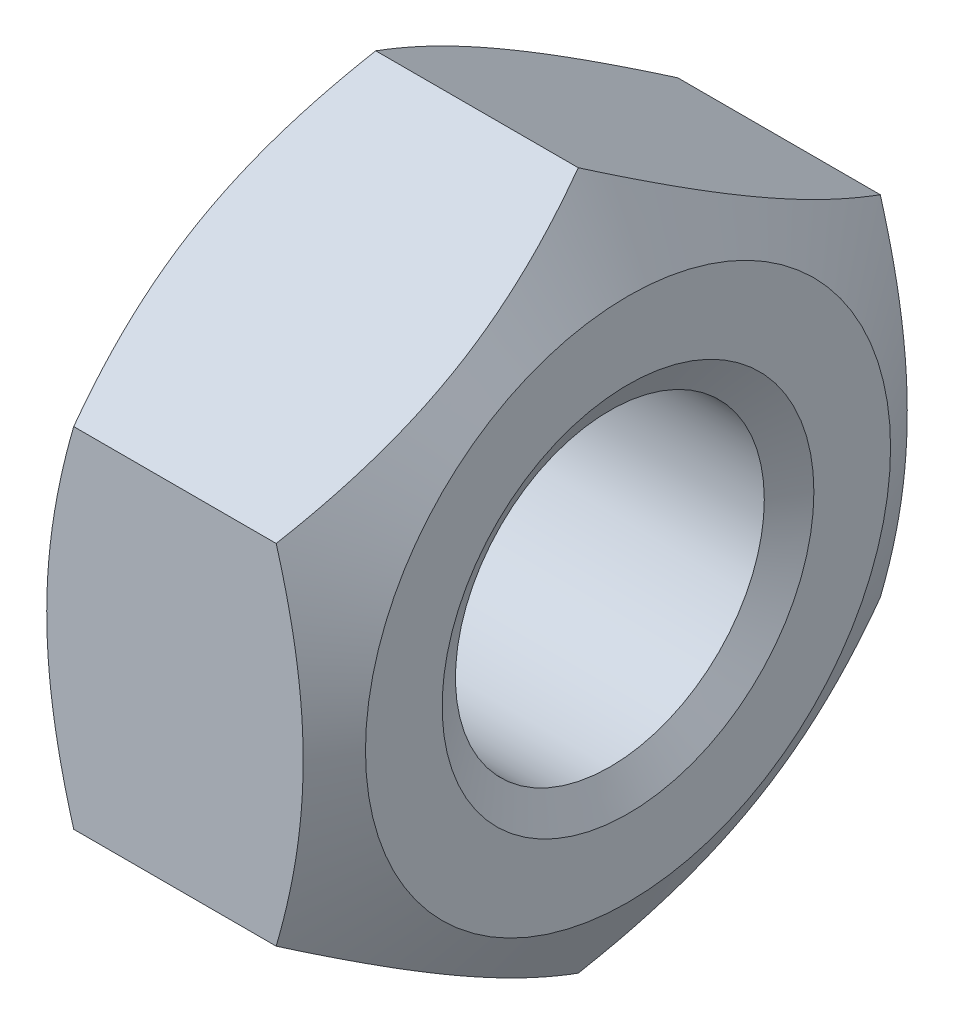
ISO-10303-21;
HEADER;
FILE_DESCRIPTION(('STEP AP214'),'2;1');
FILE_NAME('part.step','',(''),(''),'','','');
FILE_SCHEMA(('AUTOMOTIVE_DESIGN { 1 0 10303 214 1 1 1 1 }'));
ENDSEC;
DATA;
#1=APPLICATION_CONTEXT('core data for automotive mechanical design processes');
#2=APPLICATION_PROTOCOL_DEFINITION('international standard','automotive_design',2000,#1);
#3=PRODUCT_CONTEXT('',#1,'mechanical');
#4=PRODUCT('Part','Part','',(#3));
#5=PRODUCT_RELATED_PRODUCT_CATEGORY('part','',(#4));
#6=PRODUCT_DEFINITION_FORMATION('','',#4);
#7=PRODUCT_DEFINITION_CONTEXT('part definition',#1,'design');
#8=PRODUCT_DEFINITION('design','',#6,#7);
#9=PRODUCT_DEFINITION_SHAPE('','',#8);
#10=(LENGTH_UNIT() NAMED_UNIT(*) SI_UNIT(.MILLI.,.METRE.));
#11=(NAMED_UNIT(*) PLANE_ANGLE_UNIT() SI_UNIT($,.RADIAN.));
#12=(NAMED_UNIT(*) SI_UNIT($,.STERADIAN.) SOLID_ANGLE_UNIT());
#13=UNCERTAINTY_MEASURE_WITH_UNIT(LENGTH_MEASURE(1.E-05),#10,'distance_accuracy_value','');
#14=(GEOMETRIC_REPRESENTATION_CONTEXT(3) GLOBAL_UNCERTAINTY_ASSIGNED_CONTEXT((#13)) GLOBAL_UNIT_ASSIGNED_CONTEXT((#10,
#11,#12)) REPRESENTATION_CONTEXT('',''));
#15=CARTESIAN_POINT('',(0.,0.,0.));
#16=DIRECTION('',(0.,0.,1.));
#17=DIRECTION('',(1.,0.,0.));
#18=AXIS2_PLACEMENT_3D('',#15,#16,#17);
#19=CARTESIAN_POINT('',(0.,-3.75277674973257,6.5));
#20=DIRECTION('',(0.,0.,1.));
#21=DIRECTION('',(1.,0.,0.));
#22=AXIS2_PLACEMENT_3D('',#19,#20,#21);
#23=PLANE('',#22);
#24=CARTESIAN_POINT('',(5.42869565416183,3.75277677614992,6.49999996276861));
#25=CARTESIAN_POINT('',(5.4763117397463,3.58779804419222,6.49999998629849));
#26=CARTESIAN_POINT('',(5.52176664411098,3.42220419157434,6.49999999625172));
#27=CARTESIAN_POINT('',(5.607758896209,3.08967170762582,6.50000000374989));
#28=CARTESIAN_POINT('',(5.64829412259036,2.92273252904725,6.50000000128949));
#29=CARTESIAN_POINT('',(5.76172457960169,2.41924227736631,6.49999999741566));
#30=CARTESIAN_POINT('',(5.8262415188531,2.08070382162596,6.49999999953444));
#31=CARTESIAN_POINT('',(5.90189342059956,1.57408722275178,6.50000000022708));
#32=CARTESIAN_POINT('',(5.92344409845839,1.40752264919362,6.50000000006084));
#33=CARTESIAN_POINT('',(5.95958057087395,1.07364098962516,6.49999999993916));
#34=CARTESIAN_POINT('',(5.97416698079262,0.906323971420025,6.49999999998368));
#35=CARTESIAN_POINT('',(5.99600317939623,0.571399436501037,6.50000000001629));
#36=CARTESIAN_POINT('',(6.00326129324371,0.403792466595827,6.50000000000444));
#37=CARTESIAN_POINT('',(6.01029306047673,0.0684330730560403,6.49999999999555));
#38=CARTESIAN_POINT('',(6.01006694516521,-0.09931934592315,6.49999999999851));
#39=CARTESIAN_POINT('',(5.99916071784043,-0.558877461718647,6.50000000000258));
#40=CARTESIAN_POINT('',(5.98086124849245,-0.850532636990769,6.50000000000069));
#41=CARTESIAN_POINT('',(5.92283973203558,-1.43190589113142,6.4999999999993));
#42=CARTESIAN_POINT('',(5.88309786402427,-1.72162192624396,6.4999999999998));
#43=CARTESIAN_POINT('',(5.78375718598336,-2.30416466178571,6.5000000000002));
#44=CARTESIAN_POINT('',(5.72373758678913,-2.59691787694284,6.5000000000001));
#45=CARTESIAN_POINT('',(5.58751825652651,-3.17805917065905,6.4999999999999));
#46=CARTESIAN_POINT('',(5.51135051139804,-3.46645468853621,6.49999999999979));
#47=CARTESIAN_POINT('',(5.42869571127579,-3.75277666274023,6.5));
#48=B_SPLINE_CURVE_WITH_KNOTS('',3,(#24,#25,#26,#27,#28,#29,#30,#31,#32,#33,#34,#35,#36,#37,#38,
#39,#40,#41,#42,#43,#44,#45,#46,#47),.UNSPECIFIED.,.F.,.F.,(4,2,2,2,2,2,2,2,2,2,2,4),(0.,
0.515097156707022,1.03041563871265,2.06319351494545,2.56693471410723,3.07063139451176,
3.57375521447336,4.07686348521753,4.95263086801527,5.8292091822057,6.72522580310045,
7.61948392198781),.UNSPECIFIED.);
#49=CARTESIAN_POINT('',(5.42869569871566,3.75277677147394,6.49999996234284));
#50=VERTEX_POINT('',#49);
#51=CARTESIAN_POINT('',(5.42869569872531,-3.75277670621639,6.5));
#52=VERTEX_POINT('',#51);
#53=EDGE_CURVE('E92',#50,#52,#48,.T.);
#54=ORIENTED_EDGE('',*,*,#53,.F.);
#55=DIRECTION('',(1.,0.,0.));
#56=VECTOR('',#55,1.);
#57=CARTESIAN_POINT('',(0.,3.75277674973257,6.5));
#58=LINE('',#57,#56);
#59=CARTESIAN_POINT('',(1.07130430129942,3.75277670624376,6.5));
#60=VERTEX_POINT('',#59);
#61=EDGE_CURVE('E80',#60,#50,#58,.T.);
#62=ORIENTED_EDGE('',*,*,#61,.F.);
#63=CARTESIAN_POINT('',(1.07130428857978,-3.75277666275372,6.50000000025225));
#64=CARTESIAN_POINT('',(1.02368821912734,-3.58779792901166,6.50000000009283));
#65=CARTESIAN_POINT('',(0.978233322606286,-3.42220407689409,6.50000000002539));
#66=CARTESIAN_POINT('',(0.892241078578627,-3.08967159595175,6.49999999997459));
#67=CARTESIAN_POINT('',(0.851705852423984,-2.92273241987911,6.49999999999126));
#68=CARTESIAN_POINT('',(0.738275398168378,-2.41924217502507,6.50000000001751));
#69=CARTESIAN_POINT('',(0.673758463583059,-2.0807037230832,6.50000000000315));
#70=CARTESIAN_POINT('',(0.598106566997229,-1.57408713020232,6.49999999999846));
#71=CARTESIAN_POINT('',(0.576555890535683,-1.4075225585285,6.49999999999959));
#72=CARTESIAN_POINT('',(0.54041942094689,-1.07364090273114,6.50000000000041));
#73=CARTESIAN_POINT('',(0.525833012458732,-0.906323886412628,6.50000000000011));
#74=CARTESIAN_POINT('',(0.503996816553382,-0.571399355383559,6.49999999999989));
#75=CARTESIAN_POINT('',(0.496738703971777,-0.403792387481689,6.49999999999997));
#76=CARTESIAN_POINT('',(0.489706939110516,-0.0684329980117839,6.50000000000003));
#77=CARTESIAN_POINT('',(0.489933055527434,0.0993194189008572,6.50000000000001));
#78=CARTESIAN_POINT('',(0.500839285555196,0.558877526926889,6.49999999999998));
#79=CARTESIAN_POINT('',(0.519138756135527,0.850532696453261,6.49999999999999));
#80=CARTESIAN_POINT('',(0.577160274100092,1.43190593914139,6.5));
#81=CARTESIAN_POINT('',(0.616902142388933,1.72162196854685,6.5));
#82=CARTESIAN_POINT('',(0.716242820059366,2.30416469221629,6.5));
#83=CARTESIAN_POINT('',(0.776262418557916,2.59691790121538,6.5));
#84=CARTESIAN_POINT('',(0.91248174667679,3.17805918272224,6.5));
#85=CARTESIAN_POINT('',(0.988649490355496,3.46645469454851,6.5));
#86=CARTESIAN_POINT('',(1.07130428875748,3.7527766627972,6.5));
#87=B_SPLINE_CURVE_WITH_KNOTS('',3,(#63,#64,#65,#66,#67,#68,#69,#70,#71,#72,#73,#74,#75,#76,#77,
#78,#79,#80,#81,#82,#83,#84,#85,#86),.UNSPECIFIED.,.F.,.F.,(4,2,2,2,2,2,2,2,2,2,2,4),(0.,
0.515097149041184,1.03041562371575,2.06319348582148,2.56693467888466,3.07063135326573,
3.57375516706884,4.07686343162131,4.95263079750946,5.82920909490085,6.7252256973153,
7.61948379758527),.UNSPECIFIED.);
#88=CARTESIAN_POINT('',(1.07130431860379,-3.75277674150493,6.50000001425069));
#89=VERTEX_POINT('',#88);
#90=EDGE_CURVE('E116',#89,#60,#87,.T.);
#91=ORIENTED_EDGE('',*,*,#90,.F.);
#92=DIRECTION('',(1.,0.,0.));
#93=VECTOR('',#92,1.);
#94=CARTESIAN_POINT('',(0.,-3.75277674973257,6.5));
#95=LINE('',#94,#93);
#96=EDGE_CURVE('E95',#52,#89,#95,.F.);
#97=ORIENTED_EDGE('',*,*,#96,.F.);
#98=EDGE_LOOP('',(#54,#62,#91,#97));
#99=FACE_BOUND('',#98,.T.);
#100=ADVANCED_FACE('F16',(#99),#23,.T.);
#101=CARTESIAN_POINT('',(0.,3.75277674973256,6.5));
#102=DIRECTION('',(0.,0.866025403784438,0.500000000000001));
#103=DIRECTION('',(0.,-0.500000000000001,0.866025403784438));
#104=AXIS2_PLACEMENT_3D('',#101,#102,#103);
#105=PLANE('',#104);
#106=CARTESIAN_POINT('',(5.42869571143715,7.50555345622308,7.54310346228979E-08));
#107=CARTESIAN_POINT('',(5.47631178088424,7.42306408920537,0.142875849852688));
#108=CARTESIAN_POINT('',(5.52176667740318,7.34026716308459,0.286284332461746));
#109=CARTESIAN_POINT('',(5.60775892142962,7.17400092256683,0.574265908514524));
#110=CARTESIAN_POINT('',(5.64829414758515,7.09053133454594,0.718839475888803));
#111=CARTESIAN_POINT('',(5.76172460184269,6.83878621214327,1.15487481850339));
#112=CARTESIAN_POINT('',(5.82624153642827,6.66951698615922,1.44805771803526));
#113=CARTESIAN_POINT('',(5.90189343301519,6.41620868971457,1.88680055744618));
#114=CARTESIAN_POINT('',(5.92344410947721,6.33292640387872,2.03104970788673));
#115=CARTESIAN_POINT('',(5.95958057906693,6.16598557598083,2.32019970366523));
#116=CARTESIAN_POINT('',(5.97416698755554,6.08232706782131,2.4651004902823));
#117=CARTESIAN_POINT('',(5.99600318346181,5.91486480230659,2.75515364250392));
#118=CARTESIAN_POINT('',(6.00326129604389,5.83106131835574,2.90030553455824));
#119=CARTESIAN_POINT('',(6.01029306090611,5.66338162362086,3.19073528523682));
#120=CARTESIAN_POINT('',(6.01006694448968,5.57950541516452,3.33601313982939));
#121=CARTESIAN_POINT('',(5.99916071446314,5.34972636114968,3.73400213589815));
#122=CARTESIAN_POINT('',(5.98086124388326,5.2038987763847,3.98658292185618));
#123=CARTESIAN_POINT('',(5.92283972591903,4.91321215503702,4.49006691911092));
#124=CARTESIAN_POINT('',(5.88309785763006,4.76835414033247,4.74096836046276));
#125=CARTESIAN_POINT('',(5.78375717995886,4.4770827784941,5.24546515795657));
#126=CARTESIAN_POINT('',(5.72373758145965,4.33070617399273,5.49899687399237));
#127=CARTESIAN_POINT('',(5.58751825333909,4.04013553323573,6.00227998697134));
#128=CARTESIAN_POINT('',(5.51135050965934,3.89593777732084,6.25203782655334));
#129=CARTESIAN_POINT('',(5.42869571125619,3.75277679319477,6.49999992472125));
#130=B_SPLINE_CURVE_WITH_KNOTS('',3,(#106,#107,#108,#109,#110,#111,#112,#113,#114,#115,#116,
#117,#118,#119,#120,#121,#122,#123,#124,#125,#126,#127,#128,#129),.UNSPECIFIED.,.F.,.F.,(4,2,2,
2,2,2,2,2,2,2,2,4),(0.,0.515097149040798,1.03041562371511,2.06319348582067,2.5669346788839,
3.07063135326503,3.57375516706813,4.07686343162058,4.95263079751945,5.82920909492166,
6.7252256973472,7.6194837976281),.UNSPECIFIED.);
#131=CARTESIAN_POINT('',(5.4286956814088,7.50555350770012,1.4263409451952E-08));
#132=VERTEX_POINT('',#131);
#133=EDGE_CURVE('E20',#132,#50,#130,.T.);
#134=ORIENTED_EDGE('',*,*,#133,.F.);
#135=DIRECTION('',(1.,0.,0.));
#136=VECTOR('',#135,1.);
#137=CARTESIAN_POINT('',(0.,7.50555349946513,0.));
#138=LINE('',#137,#136);
#139=CARTESIAN_POINT('',(1.07130430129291,7.50555347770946,3.76819464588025E-08));
#140=VERTEX_POINT('',#139);
#141=EDGE_CURVE('E73',#140,#132,#138,.T.);
#142=ORIENTED_EDGE('',*,*,#141,.F.);
#143=CARTESIAN_POINT('',(1.07130434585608,3.7527767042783,6.50000000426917));
#144=CARTESIAN_POINT('',(1.02368826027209,3.83526609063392,6.35712424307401));
#145=CARTESIAN_POINT('',(0.97823335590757,3.91806302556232,6.21371576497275));
#146=CARTESIAN_POINT('',(0.892241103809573,4.08432927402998,5.92573419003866));
#147=CARTESIAN_POINT('',(0.851705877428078,4.16779886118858,5.78116061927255));
#148=CARTESIAN_POINT('',(0.738275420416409,4.41954398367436,5.34512526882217));
#149=CARTESIAN_POINT('',(0.673758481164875,4.58881321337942,5.05194236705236));
#150=CARTESIAN_POINT('',(0.598106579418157,4.84212151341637,4.61319952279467));
#151=CARTESIAN_POINT('',(0.57655590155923,4.92540380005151,4.46895037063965));
#152=CARTESIAN_POINT('',(0.540419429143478,5.09234462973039,4.17980037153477));
#153=CARTESIAN_POINT('',(0.525833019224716,5.17600313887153,4.03489958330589));
#154=CARTESIAN_POINT('',(0.503996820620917,5.3434654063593,3.7448464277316));
#155=CARTESIAN_POINT('',(0.496738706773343,5.42726889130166,3.5996945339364));
#156=CARTESIAN_POINT('',(0.489706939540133,5.59494858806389,3.3092647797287));
#157=CARTESIAN_POINT('',(0.489933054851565,5.67882479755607,3.16398692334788));
#158=CARTESIAN_POINT('',(0.500839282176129,5.90860385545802,2.76599792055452));
#159=CARTESIAN_POINT('',(0.519138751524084,6.05443144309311,2.51341712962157));
#160=CARTESIAN_POINT('',(0.577160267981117,6.34511807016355,2.00993312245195));
#161=CARTESIAN_POINT('',(0.616902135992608,6.48997608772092,1.75903167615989));
#162=CARTESIAN_POINT('',(0.716242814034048,6.78124745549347,1.25453486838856));
#163=CARTESIAN_POINT('',(0.776262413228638,6.92762406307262,1.0010031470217));
#164=CARTESIAN_POINT('',(0.912481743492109,7.21819470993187,0.497720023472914));
#165=CARTESIAN_POINT('',(0.988649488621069,7.362392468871,0.247962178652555));
#166=CARTESIAN_POINT('',(1.07130428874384,7.50555345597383,7.53291533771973E-08));
#167=B_SPLINE_CURVE_WITH_KNOTS('',3,(#143,#144,#145,#146,#147,#148,#149,#150,#151,#152,#153,
#154,#155,#156,#157,#158,#159,#160,#161,#162,#163,#164,#165,#166),.UNSPECIFIED.,.F.,.F.,(4,2,2,
2,2,2,2,2,2,2,2,4),(0.,0.515097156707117,1.03041563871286,2.06319351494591,2.56693471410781,
3.07063139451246,3.57375521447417,4.07686348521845,4.95263086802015,5.82920918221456,
6.72522580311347,7.61948392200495),.UNSPECIFIED.);
#168=EDGE_CURVE('E83',#60,#140,#167,.T.);
#169=ORIENTED_EDGE('',*,*,#168,.F.);
#170=ORIENTED_EDGE('',*,*,#61,.T.);
#171=EDGE_LOOP('',(#134,#142,#169,#170));
#172=FACE_BOUND('',#171,.T.);
#173=ADVANCED_FACE('F82',(#172),#105,.T.);
#174=CARTESIAN_POINT('',(0.,7.50555349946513,0.));
#175=DIRECTION('',(0.,0.866025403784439,-0.499999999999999));
#176=DIRECTION('',(0.,0.499999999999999,0.866025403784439));
#177=AXIS2_PLACEMENT_3D('',#174,#175,#176);
#178=PLANE('',#177);
#179=CARTESIAN_POINT('',(5.42869565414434,3.7527767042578,-6.50000000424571));
#180=CARTESIAN_POINT('',(5.47631173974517,3.83526609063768,-6.3571242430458));
#181=CARTESIAN_POINT('',(5.52176664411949,3.918063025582,-6.21371576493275));
#182=CARTESIAN_POINT('',(5.60775889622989,4.0843292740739,-5.92573418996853));
#183=CARTESIAN_POINT('',(5.64829412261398,4.16779886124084,-5.78116061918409));
#184=CARTESIAN_POINT('',(5.76172457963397,4.41954398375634,-5.34512526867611));
#185=CARTESIAN_POINT('',(5.82624151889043,4.58881321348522,-5.05194236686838));
#186=CARTESIAN_POINT('',(5.90189342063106,4.84212151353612,-4.61319952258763));
#187=CARTESIAN_POINT('',(5.92344409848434,4.92540380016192,-4.46895037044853));
#188=CARTESIAN_POINT('',(5.95958057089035,5.0923446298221,-4.17980037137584));
#189=CARTESIAN_POINT('',(5.97416698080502,5.17600313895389,-4.03489958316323));
#190=CARTESIAN_POINT('',(5.99600317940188,5.34346540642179,-3.74484642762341));
#191=CARTESIAN_POINT('',(6.0032612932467,5.42726889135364,-3.59969453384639));
#192=CARTESIAN_POINT('',(6.01029306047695,5.59494858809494,-3.30926477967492));
#193=CARTESIAN_POINT('',(6.01006694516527,5.6788247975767,-3.16398692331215));
#194=CARTESIAN_POINT('',(5.99916071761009,5.90860386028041,-2.7659979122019));
#195=CARTESIAN_POINT('',(5.98086124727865,6.05443145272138,-2.51341711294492));
#196=CARTESIAN_POINT('',(5.9228397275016,6.34511808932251,-2.00993308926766));
#197=CARTESIAN_POINT('',(5.88309785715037,6.4899761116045,-1.7590316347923));
#198=CARTESIAN_POINT('',(5.78375717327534,6.78124748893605,-1.2545348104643));
#199=CARTESIAN_POINT('',(5.72373757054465,6.92762410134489,-1.00100308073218));
#200=CARTESIAN_POINT('',(5.58751823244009,7.21819475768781,-0.497719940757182));
#201=CARTESIAN_POINT('',(5.5113504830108,7.36239252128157,-0.247962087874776));
#202=CARTESIAN_POINT('',(5.42869567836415,7.5055535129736,2.33973575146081E-08));
#203=B_SPLINE_CURVE_WITH_KNOTS('',3,(#179,#180,#181,#182,#183,#184,#185,#186,#187,#188,#189,
#190,#191,#192,#193,#194,#195,#196,#197,#198,#199,#200,#201,#202),.UNSPECIFIED.,.F.,.F.,(4,2,2,
2,2,2,2,2,2,2,2,4),(0.,0.51509715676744,1.03041563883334,2.06319351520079,2.5669347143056,
3.07063139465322,3.57375521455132,4.07686348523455,4.95263089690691,5.82920924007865,
6.72522589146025,7.61948404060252),.UNSPECIFIED.);
#204=CARTESIAN_POINT('',(5.42869569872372,3.75277670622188,-6.5));
#205=VERTEX_POINT('',#204);
#206=EDGE_CURVE('E94',#205,#132,#203,.T.);
#207=ORIENTED_EDGE('',*,*,#206,.F.);
#208=DIRECTION('',(-1.,0.,0.));
#209=VECTOR('',#208,1.);
#210=CARTESIAN_POINT('',(0.,3.75277674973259,-6.5));
#211=LINE('',#210,#209);
#212=CARTESIAN_POINT('',(1.07130430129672,3.75277677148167,-6.49999996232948));
#213=VERTEX_POINT('',#212);
#214=EDGE_CURVE('E189',#213,#205,#211,.F.);
#215=ORIENTED_EDGE('',*,*,#214,.F.);
#216=CARTESIAN_POINT('',(1.07130434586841,7.50555348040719,4.14999745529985E-08));
#217=CARTESIAN_POINT('',(1.02368826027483,7.42306413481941,-0.142875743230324));
#218=CARTESIAN_POINT('',(0.978233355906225,7.34026721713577,-0.28628423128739));
#219=CARTESIAN_POINT('',(0.892241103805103,7.17400098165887,-0.574265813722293));
#220=CARTESIAN_POINT('',(0.851705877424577,7.09053139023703,-0.718839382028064));
#221=CARTESIAN_POINT('',(0.73827542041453,6.83878626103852,-1.15487472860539));
#222=CARTESIAN_POINT('',(0.673758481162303,6.66951703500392,-1.44805763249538));
#223=CARTESIAN_POINT('',(0.598106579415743,6.41620873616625,-1.8868004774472));
#224=CARTESIAN_POINT('',(0.576555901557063,6.33292644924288,-2.03104962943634));
#225=CARTESIAN_POINT('',(0.540419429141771,6.16598561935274,-2.32019962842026));
#226=CARTESIAN_POINT('',(0.525833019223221,6.08232711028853,-2.46510041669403));
#227=CARTESIAN_POINT('',(0.503996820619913,5.91486484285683,-2.75515357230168));
#228=CARTESIAN_POINT('',(0.496738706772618,5.83106135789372,-2.90030546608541));
#229=CARTESIAN_POINT('',(0.489706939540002,5.66338166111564,-3.19073522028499));
#230=CARTESIAN_POINT('',(0.489933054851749,5.57950545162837,-3.33601307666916));
#231=CARTESIAN_POINT('',(0.500839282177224,5.34972639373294,-3.73400207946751));
#232=CARTESIAN_POINT('',(0.519138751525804,5.20389880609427,-3.98658287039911));
#233=CARTESIAN_POINT('',(0.577160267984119,4.91321217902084,-4.49006687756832));
#234=CARTESIAN_POINT('',(0.616902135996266,4.76835416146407,-4.74096832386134));
#235=CARTESIAN_POINT('',(0.716242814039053,4.47708279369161,-5.24546513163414));
#236=CARTESIAN_POINT('',(0.776262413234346,4.33070618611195,-5.49899685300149));
#237=CARTESIAN_POINT('',(0.91248174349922,4.04013553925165,-6.00227997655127));
#238=CARTESIAN_POINT('',(0.988649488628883,3.89593778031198,-6.25203782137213));
#239=CARTESIAN_POINT('',(1.07130428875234,3.75277679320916,-6.49999992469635));
#240=B_SPLINE_CURVE_WITH_KNOTS('',3,(#216,#217,#218,#219,#220,#221,#222,#223,#224,#225,#226,
#227,#228,#229,#230,#231,#232,#233,#234,#235,#236,#237,#238,#239),.UNSPECIFIED.,.F.,.F.,(4,2,2,
2,2,2,2,2,2,2,2,4),(0.,0.515097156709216,1.03041563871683,2.06319351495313,2.56693471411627,
3.0706313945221,3.57375521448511,4.07686348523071,4.95263086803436,5.82920918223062,
6.72522580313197,7.61948392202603),.UNSPECIFIED.);
#241=EDGE_CURVE('E159',#140,#213,#240,.T.);
#242=ORIENTED_EDGE('',*,*,#241,.F.);
#243=ORIENTED_EDGE('',*,*,#141,.T.);
#244=EDGE_LOOP('',(#207,#215,#242,#243));
#245=FACE_BOUND('',#244,.T.);
#246=ADVANCED_FACE('F163',(#245),#178,.T.);
#247=CARTESIAN_POINT('',(0.,3.75277674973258,-6.5));
#248=DIRECTION('',(0.,0.,-1.));
#249=DIRECTION('',(-1.,0.,0.));
#250=AXIS2_PLACEMENT_3D('',#247,#248,#249);
#251=PLANE('',#250);
#252=CARTESIAN_POINT('',(5.4286956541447,-3.75277677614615,-6.49999996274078));
#253=CARTESIAN_POINT('',(5.4763117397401,-3.5877980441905,-6.49999998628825));
#254=CARTESIAN_POINT('',(5.52176664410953,-3.42220419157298,-6.49999999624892));
#255=CARTESIAN_POINT('',(5.60775889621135,-3.0896717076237,-6.50000000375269));
#256=CARTESIAN_POINT('',(5.64829412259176,-2.92273252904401,-6.50000000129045));
#257=CARTESIAN_POINT('',(5.7617245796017,-2.41924227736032,-6.49999999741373));
#258=CARTESIAN_POINT('',(5.82624151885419,-2.08070382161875,-6.49999999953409));
#259=CARTESIAN_POINT('',(5.90189342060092,-1.57408722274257,-6.50000000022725));
#260=CARTESIAN_POINT('',(5.92344409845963,-1.40752264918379,-6.50000000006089));
#261=CARTESIAN_POINT('',(5.95958057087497,-1.07364098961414,-6.49999999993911));
#262=CARTESIAN_POINT('',(5.97416698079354,-0.90632397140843,-6.49999999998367));
#263=CARTESIAN_POINT('',(5.99600317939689,-0.571399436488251,-6.50000000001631));
#264=CARTESIAN_POINT('',(6.0032612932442,-0.403792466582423,-6.50000000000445));
#265=CARTESIAN_POINT('',(6.01029306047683,-0.0684330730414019,-6.49999999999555));
#266=CARTESIAN_POINT('',(6.01006694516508,0.0993193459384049,-6.49999999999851));
#267=CARTESIAN_POINT('',(5.99916071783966,0.558877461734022,-6.50000000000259));
#268=CARTESIAN_POINT('',(5.98086124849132,0.850532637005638,-6.5000000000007));
#269=CARTESIAN_POINT('',(5.92283973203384,1.43190589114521,-6.4999999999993));
#270=CARTESIAN_POINT('',(5.88309786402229,1.7216219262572,-6.4999999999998));
#271=CARTESIAN_POINT('',(5.78375718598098,2.30416466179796,-6.5000000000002));
#272=CARTESIAN_POINT('',(5.72373758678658,2.59691787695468,-6.5000000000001));
#273=CARTESIAN_POINT('',(5.58751825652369,3.17805917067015,-6.4999999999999));
#274=CARTESIAN_POINT('',(5.5113505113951,3.46645468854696,-6.49999999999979));
#275=CARTESIAN_POINT('',(5.42869571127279,3.75277666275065,-6.5));
#276=B_SPLINE_CURVE_WITH_KNOTS('',3,(#252,#253,#254,#255,#256,#257,#258,#259,#260,#261,#262,
#263,#264,#265,#266,#267,#268,#269,#270,#271,#272,#273,#274,#275),.UNSPECIFIED.,.F.,.F.,(4,2,2,
2,2,2,2,2,2,2,2,4),(0.,0.515097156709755,1.03041563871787,2.06319351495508,2.56693471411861,
3.07063139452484,3.57375521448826,4.07686348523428,4.95263086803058,5.82920918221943,
6.72522580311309,7.61948392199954),.UNSPECIFIED.);
#277=CARTESIAN_POINT('',(5.42869569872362,-3.75277677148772,-6.49999996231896));
#278=VERTEX_POINT('',#277);
#279=EDGE_CURVE('E174',#278,#205,#276,.T.);
#280=ORIENTED_EDGE('',*,*,#279,.F.);
#281=DIRECTION('',(1.,0.,0.));
#282=VECTOR('',#281,1.);
#283=CARTESIAN_POINT('',(0.,-3.75277674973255,-6.50000000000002));
#284=LINE('',#283,#282);
#285=CARTESIAN_POINT('',(1.07130430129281,-3.75277670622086,-6.50000000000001));
#286=VERTEX_POINT('',#285);
#287=EDGE_CURVE('E187',#286,#278,#284,.T.);
#288=ORIENTED_EDGE('',*,*,#287,.F.);
#289=CARTESIAN_POINT('',(1.07130434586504,3.75277677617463,-6.49999996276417));
#290=CARTESIAN_POINT('',(1.02368826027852,3.58779804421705,-6.49999998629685));
#291=CARTESIAN_POINT('',(0.978233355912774,3.42220419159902,-6.49999999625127));
#292=CARTESIAN_POINT('',(0.892241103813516,3.08967170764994,-6.50000000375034));
#293=CARTESIAN_POINT('',(0.851705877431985,2.92273252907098,-6.50000000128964));
#294=CARTESIAN_POINT('',(0.738275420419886,2.41924227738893,-6.49999999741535));
#295=CARTESIAN_POINT('',(0.673758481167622,2.08070382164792,-6.49999999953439));
#296=CARTESIAN_POINT('',(0.598106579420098,1.57408722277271,-6.5000000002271));
#297=CARTESIAN_POINT('',(0.576555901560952,1.40752264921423,-6.50000000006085));
#298=CARTESIAN_POINT('',(0.540419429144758,1.07364098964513,-6.49999999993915));
#299=CARTESIAN_POINT('',(0.525833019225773,0.90632397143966,-6.49999999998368));
#300=CARTESIAN_POINT('',(0.503996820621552,0.571399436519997,-6.5000000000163));
#301=CARTESIAN_POINT('',(0.49673870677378,0.403792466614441,-6.50000000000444));
#302=CARTESIAN_POINT('',(0.489706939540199,0.0684330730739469,-6.49999999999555));
#303=CARTESIAN_POINT('',(0.489933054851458,-0.0993193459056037,-6.49999999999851));
#304=CARTESIAN_POINT('',(0.500839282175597,-0.558877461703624,-6.50000000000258));
#305=CARTESIAN_POINT('',(0.519138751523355,-0.850532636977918,-6.5000000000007));
#306=CARTESIAN_POINT('',(0.577160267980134,-1.43190589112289,-6.4999999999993));
#307=CARTESIAN_POINT('',(0.616902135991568,-1.7216219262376,-6.4999999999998));
#308=CARTESIAN_POINT('',(0.716242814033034,-2.30416466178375,-6.5000000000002));
#309=CARTESIAN_POINT('',(0.776262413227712,-2.59691787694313,-6.5000000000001));
#310=CARTESIAN_POINT('',(0.912481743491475,-3.17805917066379,-6.4999999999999));
#311=CARTESIAN_POINT('',(0.988649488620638,-3.46645468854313,-6.49999999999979));
#312=CARTESIAN_POINT('',(1.07130428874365,-3.75277666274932,-6.5));
#313=B_SPLINE_CURVE_WITH_KNOTS('',3,(#289,#290,#291,#292,#293,#294,#295,#296,#297,#298,#299,
#300,#301,#302,#303,#304,#305,#306,#307,#308,#309,#310,#311,#312),.UNSPECIFIED.,.F.,.F.,(4,2,2,
2,2,2,2,2,2,2,2,4),(0.,0.515097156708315,1.0304156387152,2.06319351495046,2.56693471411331,
3.0706313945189,3.57375521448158,4.07686348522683,4.95263086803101,5.82920918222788,
6.72522580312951,7.61948392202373),.UNSPECIFIED.);
#314=EDGE_CURVE('E154',#213,#286,#313,.T.);
#315=ORIENTED_EDGE('',*,*,#314,.F.);
#316=ORIENTED_EDGE('',*,*,#214,.T.);
#317=EDGE_LOOP('',(#280,#288,#315,#316));
#318=FACE_BOUND('',#317,.T.);
#319=ADVANCED_FACE('F166',(#318),#251,.T.);
#320=CARTESIAN_POINT('',(0.,-3.75277674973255,-6.50000000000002));
#321=DIRECTION('',(0.,-0.866025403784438,-0.500000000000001));
#322=DIRECTION('',(0.,0.500000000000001,-0.866025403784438));
#323=AXIS2_PLACEMENT_3D('',#320,#321,#322);
#324=PLANE('',#323);
#325=CARTESIAN_POINT('',(5.42869565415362,-7.50555348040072,4.14862084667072E-08));
#326=CARTESIAN_POINT('',(5.47631173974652,-7.42306413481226,-0.142875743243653));
#327=CARTESIAN_POINT('',(5.52176664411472,-7.34026721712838,-0.286284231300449));
#328=CARTESIAN_POINT('',(5.60775889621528,-7.17400098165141,-0.574265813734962));
#329=CARTESIAN_POINT('',(5.64829412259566,-7.09053139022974,-0.718839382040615));
#330=CARTESIAN_POINT('',(5.76172457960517,-6.83878626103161,-1.15487472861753));
#331=CARTESIAN_POINT('',(5.82624151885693,-6.66951703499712,-1.44805763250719));
#332=CARTESIAN_POINT('',(5.90189342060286,-6.41620873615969,-1.88680047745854));
#333=CARTESIAN_POINT('',(5.92344409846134,-6.3329264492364,-2.03104962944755));
#334=CARTESIAN_POINT('',(5.95958057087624,-6.16598561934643,-2.32019962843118));
#335=CARTESIAN_POINT('',(5.9741669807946,-6.0823271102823,-2.46510041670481));
#336=CARTESIAN_POINT('',(5.99600317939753,-5.91486484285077,-2.75515357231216));
#337=CARTESIAN_POINT('',(6.00326129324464,-5.83106135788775,-2.90030546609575));
#338=CARTESIAN_POINT('',(6.0102930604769,-5.66338166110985,-3.19073522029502));
#339=CARTESIAN_POINT('',(6.01006694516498,-5.57950545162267,-3.33601307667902));
#340=CARTESIAN_POINT('',(5.99916071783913,-5.34972639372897,-3.73400207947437));
#341=CARTESIAN_POINT('',(5.9808612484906,-5.20389880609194,-3.98658287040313));
#342=CARTESIAN_POINT('',(5.92283973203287,-4.91321217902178,-4.49006687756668));
#343=CARTESIAN_POINT('',(5.88309786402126,-4.76835416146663,-4.74096832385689));
#344=CARTESIAN_POINT('',(5.78375718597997,-4.47708279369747,-5.24546513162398));
#345=CARTESIAN_POINT('',(5.72373758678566,-4.33070618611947,-5.49899685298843));
#346=CARTESIAN_POINT('',(5.58751825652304,-4.04013553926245,-6.00227997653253));
#347=CARTESIAN_POINT('',(5.51135051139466,-3.8959377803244,-6.2520378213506));
#348=CARTESIAN_POINT('',(5.42869571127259,-3.75277679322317,-6.49999992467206));
#349=B_SPLINE_CURVE_WITH_KNOTS('',3,(#325,#326,#327,#328,#329,#330,#331,#332,#333,#334,#335,
#336,#337,#338,#339,#340,#341,#342,#343,#344,#345,#346,#347,#348),.UNSPECIFIED.,.F.,.F.,(4,2,2,
2,2,2,2,2,2,2,2,4),(0.,0.51509715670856,1.03041563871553,2.06319351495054,2.56693471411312,
3.07063139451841,3.57375521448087,4.07686348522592,4.95263086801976,5.82920918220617,
6.72522580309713,7.61948392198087),.UNSPECIFIED.);
#350=CARTESIAN_POINT('',(5.42869569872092,-7.50555347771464,3.76729568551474E-08));
#351=VERTEX_POINT('',#350);
#352=EDGE_CURVE('E98',#351,#278,#349,.T.);
#353=ORIENTED_EDGE('',*,*,#352,.F.);
#354=DIRECTION('',(1.,0.,0.));
#355=VECTOR('',#354,1.);
#356=CARTESIAN_POINT('',(0.,-7.50555349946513,0.));
#357=LINE('',#356,#355);
#358=CARTESIAN_POINT('',(1.07130430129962,-7.50555347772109,-3.76617956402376E-08));
#359=VERTEX_POINT('',#358);
#360=EDGE_CURVE('E191',#359,#351,#357,.T.);
#361=ORIENTED_EDGE('',*,*,#360,.F.);
#362=CARTESIAN_POINT('',(1.07130434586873,-3.75277670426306,-6.50000000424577));
#363=CARTESIAN_POINT('',(1.02368826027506,-3.83526609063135,-6.35712424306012));
#364=CARTESIAN_POINT('',(0.978233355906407,-3.91806302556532,-6.21371576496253));
#365=CARTESIAN_POINT('',(0.892241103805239,-4.08432927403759,-5.92573419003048));
#366=CARTESIAN_POINT('',(0.851705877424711,-4.16779886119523,-5.78116061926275));
#367=CARTESIAN_POINT('',(0.738275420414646,-4.41954398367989,-5.34512526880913));
#368=CARTESIAN_POINT('',(0.673758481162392,-4.58881321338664,-5.05194236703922));
#369=CARTESIAN_POINT('',(0.598106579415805,-4.84212151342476,-4.61319952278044));
#370=CARTESIAN_POINT('',(0.576555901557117,-4.92540380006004,-4.46895037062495));
#371=CARTESIAN_POINT('',(0.540419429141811,-5.09234462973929,-4.17980037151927));
#372=CARTESIAN_POINT('',(0.525833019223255,-5.17600313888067,-4.03489958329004));
#373=CARTESIAN_POINT('',(0.503996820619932,-5.34346540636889,-3.74484642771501));
#374=CARTESIAN_POINT('',(0.496738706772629,-5.42726889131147,-3.59969453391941));
#375=CARTESIAN_POINT('',(0.48970693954,-5.59494858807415,-3.30926477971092));
#376=CARTESIAN_POINT('',(0.489933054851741,-5.67882479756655,-3.16398692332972));
#377=CARTESIAN_POINT('',(0.50083928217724,-5.90860385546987,-2.765997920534));
#378=CARTESIAN_POINT('',(0.519138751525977,-6.05443144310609,-2.51341712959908));
#379=CARTESIAN_POINT('',(0.577160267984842,-6.34511807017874,-2.00993312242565));
#380=CARTESIAN_POINT('',(0.61690213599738,-6.48997608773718,-1.75903167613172));
#381=CARTESIAN_POINT('',(0.716242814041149,-6.78124745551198,-1.25453486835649));
#382=CARTESIAN_POINT('',(0.776262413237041,-6.9276240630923,-1.0010031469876));
#383=CARTESIAN_POINT('',(0.912481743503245,-7.21819470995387,-0.497720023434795));
#384=CARTESIAN_POINT('',(0.988649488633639,-7.36239246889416,-0.247962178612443));
#385=CARTESIAN_POINT('',(1.07130428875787,-7.50555345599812,-7.52870720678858E-08));
#386=B_SPLINE_CURVE_WITH_KNOTS('',3,(#362,#363,#364,#365,#366,#367,#368,#369,#370,#371,#372,
#373,#374,#375,#376,#377,#378,#379,#380,#381,#382,#383,#384,#385),.UNSPECIFIED.,.F.,.F.,(4,2,2,
2,2,2,2,2,2,2,2,4),(0.,0.515097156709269,1.03041563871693,2.06319351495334,2.56693471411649,
3.07063139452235,3.57375521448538,4.07686348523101,4.95263086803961,5.82920918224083,
6.72522580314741,7.61948392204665),.UNSPECIFIED.);
#387=EDGE_CURVE('E40',#286,#359,#386,.T.);
#388=ORIENTED_EDGE('',*,*,#387,.F.);
#389=ORIENTED_EDGE('',*,*,#287,.T.);
#390=EDGE_LOOP('',(#353,#361,#388,#389));
#391=FACE_BOUND('',#390,.T.);
#392=ADVANCED_FACE('F170',(#391),#324,.T.);
#393=CARTESIAN_POINT('',(0.,-7.50555349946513,0.));
#394=DIRECTION('',(0.,-0.866025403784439,0.5));
#395=DIRECTION('',(0.,-0.5,-0.866025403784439));
#396=AXIS2_PLACEMENT_3D('',#393,#394,#395);
#397=PLANE('',#396);
#398=CARTESIAN_POINT('',(5.4286956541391,-3.75277670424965,6.50000000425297));
#399=CARTESIAN_POINT('',(5.47631173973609,-3.83526609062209,6.35712424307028));
#400=CARTESIAN_POINT('',(5.52176664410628,-3.91806302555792,6.21371576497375));
#401=CARTESIAN_POINT('',(5.60775889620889,-4.08432927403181,5.92573419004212));
#402=CARTESIAN_POINT('',(5.64829412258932,-4.16779886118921,5.78116061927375));
#403=CARTESIAN_POINT('',(5.76172457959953,-4.41954398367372,5.34512526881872));
#404=CARTESIAN_POINT('',(5.82624151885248,-4.58881321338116,5.05194236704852));
#405=CARTESIAN_POINT('',(5.90189342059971,-4.84212151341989,4.61319952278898));
#406=CARTESIAN_POINT('',(5.92344409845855,-4.92540380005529,4.46895037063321));
#407=CARTESIAN_POINT('',(5.95958057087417,-5.09234462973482,4.17980037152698));
#408=CARTESIAN_POINT('',(5.97416698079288,-5.17600313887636,4.0348995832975));
#409=CARTESIAN_POINT('',(5.99600317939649,-5.3434654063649,3.74484642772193));
#410=CARTESIAN_POINT('',(6.00326129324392,-5.42726889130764,3.59969453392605));
#411=CARTESIAN_POINT('',(6.01029306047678,-5.59494858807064,3.309264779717));
#412=CARTESIAN_POINT('',(6.01006694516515,-5.67882479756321,3.1639869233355));
#413=CARTESIAN_POINT('',(5.99916071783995,-5.9086038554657,2.76599792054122));
#414=CARTESIAN_POINT('',(5.98086124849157,-6.05443144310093,2.51341712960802));
#415=CARTESIAN_POINT('',(5.92283973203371,-6.34511807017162,2.00993312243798));
#416=CARTESIAN_POINT('',(5.8830978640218,-6.48997608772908,1.75903167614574));
#417=CARTESIAN_POINT('',(5.78375718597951,-6.78124745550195,1.25453486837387));
#418=CARTESIAN_POINT('',(5.72373758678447,-6.9276240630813,1.00100314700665));
#419=CARTESIAN_POINT('',(5.58751825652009,-7.21819470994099,0.49772002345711));
#420=CARTESIAN_POINT('',(5.51135051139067,-7.36239246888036,0.247962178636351));
#421=CARTESIAN_POINT('',(5.42869571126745,-7.50555345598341,7.53125526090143E-08));
#422=B_SPLINE_CURVE_WITH_KNOTS('',3,(#398,#399,#400,#401,#402,#403,#404,#405,#406,#407,#408,
#409,#410,#411,#412,#413,#414,#415,#416,#417,#418,#419,#420,#421),.UNSPECIFIED.,.F.,.F.,(4,2,2,
2,2,2,2,2,2,2,2,4),(0.,0.515097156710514,1.03041563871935,2.06319351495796,2.56693471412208,
3.07063139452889,3.5737552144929,4.07686348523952,4.95263086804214,5.82920918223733,
6.72522580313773,7.6194839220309),.UNSPECIFIED.);
#423=EDGE_CURVE('E97',#52,#351,#422,.T.);
#424=ORIENTED_EDGE('',*,*,#423,.F.);
#425=ORIENTED_EDGE('',*,*,#96,.T.);
#426=CARTESIAN_POINT('',(1.07130434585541,-7.50555348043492,-4.14977591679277E-08));
#427=CARTESIAN_POINT('',(1.02368826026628,-7.42306413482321,0.142875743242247));
#428=CARTESIAN_POINT('',(0.978233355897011,-7.34026721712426,0.286284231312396));
#429=CARTESIAN_POINT('',(0.892241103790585,-7.17400098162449,0.574265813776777));
#430=CARTESIAN_POINT('',(0.851705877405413,-7.09053139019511,0.718839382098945));
#431=CARTESIAN_POINT('',(0.73827542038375,-6.83878626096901,1.15487472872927));
#432=CARTESIAN_POINT('',(0.673758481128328,-6.66951703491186,1.44805763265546));
#433=CARTESIAN_POINT('',(0.5981065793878,-6.41620873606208,1.88680047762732));
#434=CARTESIAN_POINT('',(0.576555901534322,-6.33292644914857,2.03104962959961));
#435=CARTESIAN_POINT('',(0.540419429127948,-6.16598561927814,2.32019962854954));
#436=CARTESIAN_POINT('',(0.525833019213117,-6.08232711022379,2.46510041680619));
#437=CARTESIAN_POINT('',(0.503996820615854,-5.91486484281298,2.75515357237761));
#438=CARTESIAN_POINT('',(0.496738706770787,-5.8310613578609,2.90030546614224));
#439=CARTESIAN_POINT('',(0.489706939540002,-5.66338166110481,3.19073522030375));
#440=CARTESIAN_POINT('',(0.489933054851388,-5.57950545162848,3.33601307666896));
#441=CARTESIAN_POINT('',(0.500839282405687,-5.34972638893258,3.73400208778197));
#442=CARTESIAN_POINT('',(0.519138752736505,-5.20389879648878,3.98658288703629));
#443=CARTESIAN_POINT('',(0.577160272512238,-4.91321215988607,4.49006691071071));
#444=CARTESIAN_POINT('',(0.616902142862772,-4.76835413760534,4.74096836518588));
#445=CARTESIAN_POINT('',(0.716242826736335,-4.47708276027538,5.24546518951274));
#446=CARTESIAN_POINT('',(0.776262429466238,-4.33070614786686,5.49899691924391));
#447=CARTESIAN_POINT('',(0.912481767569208,-4.04013549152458,6.00228005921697));
#448=CARTESIAN_POINT('',(0.988649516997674,-3.89593772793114,6.2520379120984));
#449=CARTESIAN_POINT('',(1.07130432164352,-3.75277673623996,6.50000002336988));
#450=B_SPLINE_CURVE_WITH_KNOTS('',3,(#426,#427,#428,#429,#430,#431,#432,#433,#434,#435,#436,
#437,#438,#439,#440,#441,#442,#443,#444,#445,#446,#447,#448,#449),.UNSPECIFIED.,.F.,.F.,(4,2,2,
2,2,2,2,2,2,2,2,4),(0.,0.515097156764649,1.03041563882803,2.06319351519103,2.56693471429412,
3.07063139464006,3.57375521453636,4.07686348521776,4.95263089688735,5.82920924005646,
6.72522589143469,7.61948404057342),.UNSPECIFIED.);
#451=EDGE_CURVE('E142',#359,#89,#450,.T.);
#452=ORIENTED_EDGE('',*,*,#451,.F.);
#453=ORIENTED_EDGE('',*,*,#360,.T.);
#454=EDGE_LOOP('',(#424,#425,#452,#453));
#455=FACE_BOUND('',#454,.T.);
#456=ADVANCED_FACE('F210',(#455),#397,.T.);
#457=CARTESIAN_POINT('',(5.42226786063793,0.,0.));
#458=DIRECTION('',(-1.,0.,0.));
#459=DIRECTION('',(0.,0.,1.));
#460=AXIS2_PLACEMENT_3D('',#457,#458,#459);
#461=CONICAL_SURFACE('',#460,7.51668681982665,1.04719755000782);
#462=CARTESIAN_POINT('',(6.50000000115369,0.,0.));
#463=DIRECTION('',(-1.,0.,0.));
#464=DIRECTION('',(0.,0.,1.));
#465=AXIS2_PLACEMENT_3D('',#462,#463,#464);
#466=CIRCLE('',#465,5.6500000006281);
#467=CARTESIAN_POINT('',(6.50000000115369,0.,5.6500000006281));
#468=VERTEX_POINT('',#467);
#469=EDGE_CURVE('E204',#468,#468,#466,.F.);
#470=ORIENTED_EDGE('',*,*,#469,.F.);
#471=EDGE_LOOP('',(#470));
#472=FACE_BOUND('',#471,.T.);
#473=ORIENTED_EDGE('',*,*,#279,.T.);
#474=ORIENTED_EDGE('',*,*,#206,.T.);
#475=ORIENTED_EDGE('',*,*,#133,.T.);
#476=ORIENTED_EDGE('',*,*,#53,.T.);
#477=ORIENTED_EDGE('',*,*,#423,.T.);
#478=ORIENTED_EDGE('',*,*,#352,.T.);
#479=EDGE_LOOP('',(#473,#474,#475,#476,#477,#478));
#480=FACE_BOUND('',#479,.T.);
#481=ADVANCED_FACE('F90',(#472,#480),#461,.T.);
#482=CARTESIAN_POINT('',(1.0777321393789,0.,0.));
#483=DIRECTION('',(1.,0.,0.));
#484=DIRECTION('',(0.,0.,-1.));
#485=AXIS2_PLACEMENT_3D('',#482,#483,#484);
#486=CONICAL_SURFACE('',#485,7.51668681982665,1.04719755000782);
#487=CARTESIAN_POINT('',(-1.13686837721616E-09,0.,0.));
#488=DIRECTION('',(1.,0.,0.));
#489=DIRECTION('',(0.,0.,-1.));
#490=AXIS2_PLACEMENT_3D('',#487,#488,#489);
#491=CIRCLE('',#490,5.6500000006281);
#492=CARTESIAN_POINT('',(-1.13686837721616E-09,0.,-5.6500000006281));
#493=VERTEX_POINT('',#492);
#494=EDGE_CURVE('E202',#493,#493,#491,.T.);
#495=ORIENTED_EDGE('',*,*,#494,.T.);
#496=EDGE_LOOP('',(#495));
#497=FACE_BOUND('',#496,.T.);
#498=ORIENTED_EDGE('',*,*,#387,.T.);
#499=ORIENTED_EDGE('',*,*,#451,.T.);
#500=ORIENTED_EDGE('',*,*,#90,.T.);
#501=ORIENTED_EDGE('',*,*,#168,.T.);
#502=ORIENTED_EDGE('',*,*,#241,.T.);
#503=ORIENTED_EDGE('',*,*,#314,.T.);
#504=EDGE_LOOP('',(#498,#499,#500,#501,#502,#503));
#505=FACE_BOUND('',#504,.T.);
#506=ADVANCED_FACE('F130',(#497,#505),#486,.T.);
#507=CARTESIAN_POINT('',(6.5,0.,0.));
#508=DIRECTION('',(1.,0.,0.));
#509=DIRECTION('',(0.,0.,-1.));
#510=AXIS2_PLACEMENT_3D('',#507,#508,#509);
#511=PLANE('',#510);
#512=CARTESIAN_POINT('',(6.50000000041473,0.,0.));
#513=DIRECTION('',(1.,0.,0.));
#514=DIRECTION('',(0.,0.,-1.));
#515=AXIS2_PLACEMENT_3D('',#512,#513,#514);
#516=CIRCLE('',#515,4.00008234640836);
#517=CARTESIAN_POINT('',(6.50000000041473,0.,-4.00008234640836));
#518=VERTEX_POINT('',#517);
#519=EDGE_CURVE('E199',#518,#518,#516,.F.);
#520=ORIENTED_EDGE('',*,*,#519,.T.);
#521=EDGE_LOOP('',(#520));
#522=FACE_BOUND('',#521,.T.);
#523=ORIENTED_EDGE('',*,*,#469,.T.);
#524=EDGE_LOOP('',(#523));
#525=FACE_BOUND('',#524,.T.);
#526=ADVANCED_FACE('F134',(#522,#525),#511,.T.);
#527=CARTESIAN_POINT('',(0.,0.,0.));
#528=DIRECTION('',(1.,0.,0.));
#529=DIRECTION('',(0.,0.,-1.));
#530=AXIS2_PLACEMENT_3D('',#527,#528,#529);
#531=PLANE('',#530);
#532=CARTESIAN_POINT('',(-3.97903932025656E-10,0.,0.));
#533=DIRECTION('',(-1.,0.,0.));
#534=DIRECTION('',(0.,-1.,0.));
#535=AXIS2_PLACEMENT_3D('',#532,#533,#534);
#536=CIRCLE('',#535,4.00008234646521);
#537=CARTESIAN_POINT('',(-3.97903932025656E-10,-4.00008234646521,0.));
#538=VERTEX_POINT('',#537);
#539=EDGE_CURVE('E196',#538,#538,#536,.F.);
#540=ORIENTED_EDGE('',*,*,#539,.T.);
#541=EDGE_LOOP('',(#540));
#542=FACE_BOUND('',#541,.T.);
#543=ORIENTED_EDGE('',*,*,#494,.F.);
#544=EDGE_LOOP('',(#543));
#545=FACE_BOUND('',#544,.T.);
#546=ADVANCED_FACE('F236',(#542,#545),#531,.F.);
#547=CARTESIAN_POINT('',(6.50000000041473,0.,0.));
#548=DIRECTION('',(1.,0.,0.));
#549=DIRECTION('',(0.,0.,-1.));
#550=AXIS2_PLACEMENT_3D('',#547,#548,#549);
#551=CONICAL_SURFACE('',#550,4.00008234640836,1.04719754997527);
#552=ORIENTED_EDGE('',*,*,#519,.F.);
#553=EDGE_LOOP('',(#552));
#554=FACE_BOUND('',#553,.T.);
#555=CARTESIAN_POINT('',(6.109375,0.,0.));
#556=DIRECTION('',(-1.,0.,0.));
#557=DIRECTION('',(0.,-1.,0.));
#558=AXIS2_PLACEMENT_3D('',#555,#556,#557);
#559=CIRCLE('',#558,3.3235);
#560=CARTESIAN_POINT('',(6.109375,-3.3235,0.));
#561=VERTEX_POINT('',#560);
#562=EDGE_CURVE('E31',#561,#561,#559,.T.);
#563=ORIENTED_EDGE('',*,*,#562,.T.);
#564=EDGE_LOOP('',(#563));
#565=FACE_BOUND('',#564,.T.);
#566=ADVANCED_FACE('F220',(#554,#565),#551,.F.);
#567=CARTESIAN_POINT('',(-3.97903932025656E-10,0.,0.));
#568=DIRECTION('',(-1.,0.,0.));
#569=DIRECTION('',(0.,-1.,0.));
#570=AXIS2_PLACEMENT_3D('',#567,#568,#569);
#571=CONICAL_SURFACE('',#570,4.00008234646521,1.04719755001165);
#572=ORIENTED_EDGE('',*,*,#539,.F.);
#573=EDGE_LOOP('',(#572));
#574=FACE_BOUND('',#573,.T.);
#575=CARTESIAN_POINT('',(0.390625,0.,0.));
#576=DIRECTION('',(1.,0.,0.));
#577=DIRECTION('',(0.,1.,0.));
#578=AXIS2_PLACEMENT_3D('',#575,#576,#577);
#579=CIRCLE('',#578,3.3235);
#580=CARTESIAN_POINT('',(0.390625,3.3235,0.));
#581=VERTEX_POINT('',#580);
#582=EDGE_CURVE('E11',#581,#581,#579,.T.);
#583=ORIENTED_EDGE('',*,*,#582,.T.);
#584=EDGE_LOOP('',(#583));
#585=FACE_BOUND('',#584,.T.);
#586=ADVANCED_FACE('F223',(#574,#585),#571,.F.);
#587=CARTESIAN_POINT('',(6.109375,0.,0.));
#588=DIRECTION('',(-1.,0.,0.));
#589=DIRECTION('',(0.,-1.,0.));
#590=AXIS2_PLACEMENT_3D('',#587,#588,#589);
#591=CYLINDRICAL_SURFACE('',#590,3.3235);
#592=ORIENTED_EDGE('',*,*,#582,.F.);
#593=EDGE_LOOP('',(#592));
#594=FACE_BOUND('',#593,.T.);
#595=ORIENTED_EDGE('',*,*,#562,.F.);
#596=EDGE_LOOP('',(#595));
#597=FACE_BOUND('',#596,.T.);
#598=ADVANCED_FACE('F18',(#594,#597),#591,.F.);
#599=CLOSED_SHELL('',(#100,#173,#246,#319,#392,#456,#481,#506,#526,#546,#566,#586,#598));
#600=MANIFOLD_SOLID_BREP('B1',#599);
#601=ADVANCED_BREP_SHAPE_REPRESENTATION('',(#18,#600),#14);
#602=SHAPE_DEFINITION_REPRESENTATION(#9,#601);
ENDSEC;
END-ISO-10303-21;
